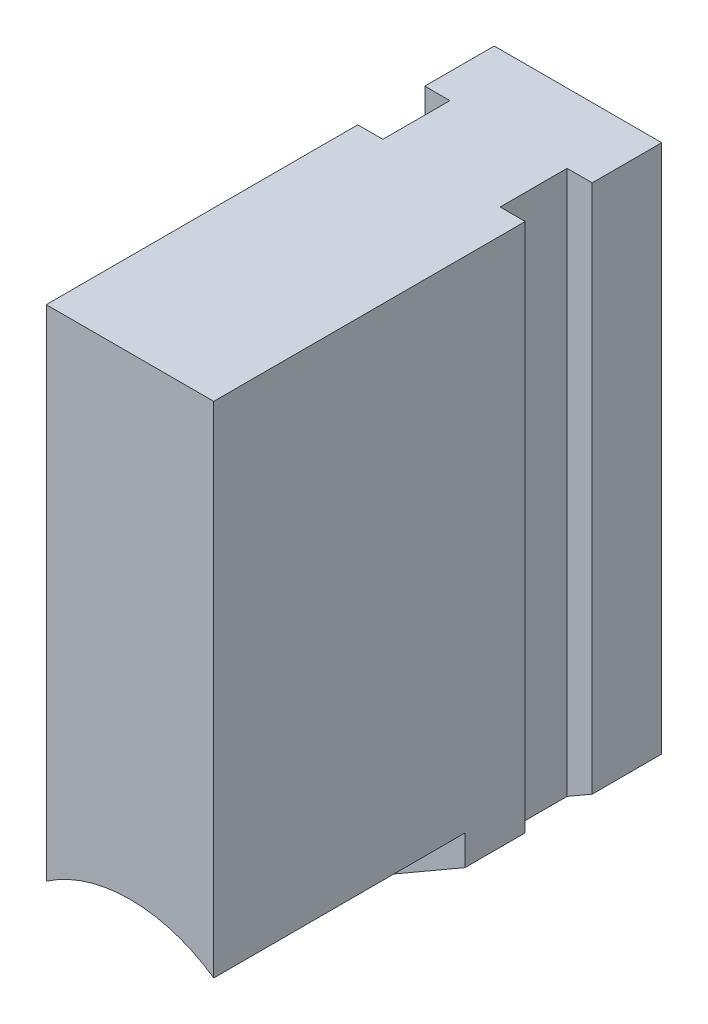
ISO-10303-21;
HEADER;
FILE_DESCRIPTION(('STEP AP214'),'2;1');
FILE_NAME('part.step','',(''),(''),'','','');
FILE_SCHEMA(('AUTOMOTIVE_DESIGN { 1 0 10303 214 1 1 1 1 }'));
ENDSEC;
DATA;
#1=APPLICATION_CONTEXT('core data for automotive mechanical design processes');
#2=APPLICATION_PROTOCOL_DEFINITION('international standard','automotive_design',2000,#1);
#3=PRODUCT_CONTEXT('',#1,'mechanical');
#4=PRODUCT('Part','Part','',(#3));
#5=PRODUCT_RELATED_PRODUCT_CATEGORY('part','',(#4));
#6=PRODUCT_DEFINITION_FORMATION('','',#4);
#7=PRODUCT_DEFINITION_CONTEXT('part definition',#1,'design');
#8=PRODUCT_DEFINITION('design','',#6,#7);
#9=PRODUCT_DEFINITION_SHAPE('','',#8);
#10=(LENGTH_UNIT() NAMED_UNIT(*) SI_UNIT(.MILLI.,.METRE.));
#11=(NAMED_UNIT(*) PLANE_ANGLE_UNIT() SI_UNIT($,.RADIAN.));
#12=(NAMED_UNIT(*) SI_UNIT($,.STERADIAN.) SOLID_ANGLE_UNIT());
#13=UNCERTAINTY_MEASURE_WITH_UNIT(LENGTH_MEASURE(1.E-05),#10,'distance_accuracy_value','');
#14=(GEOMETRIC_REPRESENTATION_CONTEXT(3) GLOBAL_UNCERTAINTY_ASSIGNED_CONTEXT((#13)) GLOBAL_UNIT_ASSIGNED_CONTEXT((#10,
#11,#12)) REPRESENTATION_CONTEXT('',''));
#15=CARTESIAN_POINT('',(0.,0.,0.));
#16=DIRECTION('',(0.,0.,1.));
#17=DIRECTION('',(1.,0.,0.));
#18=AXIS2_PLACEMENT_3D('',#15,#16,#17);
#19=CARTESIAN_POINT('',(0.,0.,32.5));
#20=DIRECTION('',(0.499999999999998,0.86602540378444,0.));
#21=DIRECTION('',(-0.86602540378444,0.499999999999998,0.));
#22=AXIS2_PLACEMENT_3D('',#19,#20,#21);
#23=PLANE('',#22);
#24=DIRECTION('',(0.86602540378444,-0.499999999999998,0.));
#25=VECTOR('',#24,1.);
#26=CARTESIAN_POINT('',(0.,0.,2.5));
#27=LINE('',#26,#25);
#28=CARTESIAN_POINT('',(-10.,5.77350269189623,2.5));
#29=VERTEX_POINT('',#28);
#30=CARTESIAN_POINT('',(0.,0.,2.5));
#31=VERTEX_POINT('',#30);
#32=EDGE_CURVE('E145',#29,#31,#27,.T.);
#33=ORIENTED_EDGE('',*,*,#32,.F.);
#34=DIRECTION('',(0.,0.,-1.));
#35=VECTOR('',#34,1.);
#36=CARTESIAN_POINT('',(-10.,5.77350269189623,32.5));
#37=LINE('',#36,#35);
#38=CARTESIAN_POINT('',(-10.,5.77350269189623,-4.7));
#39=VERTEX_POINT('',#38);
#40=EDGE_CURVE('E222',#29,#39,#37,.T.);
#41=ORIENTED_EDGE('',*,*,#40,.T.);
#42=DIRECTION('',(-0.86602540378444,0.499999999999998,0.));
#43=VECTOR('',#42,1.);
#44=CARTESIAN_POINT('',(0.,0.,-4.7));
#45=LINE('',#44,#43);
#46=CARTESIAN_POINT('',(-7.,4.04145188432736,-4.7));
#47=VERTEX_POINT('',#46);
#48=EDGE_CURVE('E39',#47,#39,#45,.T.);
#49=ORIENTED_EDGE('',*,*,#48,.F.);
#50=DIRECTION('',(0.,0.,1.));
#51=VECTOR('',#50,1.);
#52=CARTESIAN_POINT('',(-7.,4.04145188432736,32.5));
#53=LINE('',#52,#51);
#54=CARTESIAN_POINT('',(-7.,4.04145188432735,-12.7));
#55=VERTEX_POINT('',#54);
#56=EDGE_CURVE('E240',#55,#47,#53,.T.);
#57=ORIENTED_EDGE('',*,*,#56,.F.);
#58=DIRECTION('',(0.86602540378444,-0.499999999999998,0.));
#59=VECTOR('',#58,1.);
#60=CARTESIAN_POINT('',(0.,0.,-12.7));
#61=LINE('',#60,#59);
#62=CARTESIAN_POINT('',(-10.,5.77350269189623,-12.7));
#63=VERTEX_POINT('',#62);
#64=EDGE_CURVE('E238',#63,#55,#61,.T.);
#65=ORIENTED_EDGE('',*,*,#64,.F.);
#66=CARTESIAN_POINT('',(-10.,5.77350269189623,-21.));
#67=VERTEX_POINT('',#66);
#68=EDGE_CURVE('E221',#63,#67,#37,.T.);
#69=ORIENTED_EDGE('',*,*,#68,.T.);
#70=DIRECTION('',(0.86602540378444,-0.499999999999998,0.));
#71=VECTOR('',#70,1.);
#72=CARTESIAN_POINT('',(0.,0.,-21.));
#73=LINE('',#72,#71);
#74=CARTESIAN_POINT('',(0.,0.,-21.));
#75=VERTEX_POINT('',#74);
#76=EDGE_CURVE('E204',#67,#75,#73,.T.);
#77=ORIENTED_EDGE('',*,*,#76,.T.);
#78=DIRECTION('',(0.,0.,-1.));
#79=VECTOR('',#78,1.);
#80=CARTESIAN_POINT('',(0.,0.,32.5));
#81=LINE('',#80,#79);
#82=EDGE_CURVE('E219',#31,#75,#81,.T.);
#83=ORIENTED_EDGE('',*,*,#82,.F.);
#84=EDGE_LOOP('',(#33,#41,#49,#57,#65,#69,#77,#83));
#85=FACE_BOUND('',#84,.T.);
#86=ADVANCED_FACE('F31',(#85),#23,.F.);
#87=CARTESIAN_POINT('',(0.,0.,32.5));
#88=DIRECTION('',(-0.499999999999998,0.86602540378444,0.));
#89=DIRECTION('',(-0.86602540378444,-0.499999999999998,0.));
#90=AXIS2_PLACEMENT_3D('',#87,#88,#89);
#91=PLANE('',#90);
#92=DIRECTION('',(0.86602540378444,0.499999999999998,0.));
#93=VECTOR('',#92,1.);
#94=CARTESIAN_POINT('',(0.,0.,2.5));
#95=LINE('',#94,#93);
#96=CARTESIAN_POINT('',(10.,5.77350269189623,2.5));
#97=VERTEX_POINT('',#96);
#98=EDGE_CURVE('E11',#31,#97,#95,.T.);
#99=ORIENTED_EDGE('',*,*,#98,.F.);
#100=ORIENTED_EDGE('',*,*,#82,.T.);
#101=DIRECTION('',(0.86602540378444,0.499999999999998,0.));
#102=VECTOR('',#101,1.);
#103=CARTESIAN_POINT('',(0.,0.,-21.));
#104=LINE('',#103,#102);
#105=CARTESIAN_POINT('',(10.,5.77350269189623,-21.));
#106=VERTEX_POINT('',#105);
#107=EDGE_CURVE('E207',#75,#106,#104,.T.);
#108=ORIENTED_EDGE('',*,*,#107,.T.);
#109=DIRECTION('',(0.,0.,-1.));
#110=VECTOR('',#109,1.);
#111=CARTESIAN_POINT('',(10.,5.77350269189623,32.5));
#112=LINE('',#111,#110);
#113=CARTESIAN_POINT('',(10.,5.77350269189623,-12.7));
#114=VERTEX_POINT('',#113);
#115=EDGE_CURVE('E216',#114,#106,#112,.T.);
#116=ORIENTED_EDGE('',*,*,#115,.F.);
#117=DIRECTION('',(0.86602540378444,0.499999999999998,0.));
#118=VECTOR('',#117,1.);
#119=CARTESIAN_POINT('',(0.,0.,-12.7));
#120=LINE('',#119,#118);
#121=CARTESIAN_POINT('',(7.,4.04145188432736,-12.7));
#122=VERTEX_POINT('',#121);
#123=EDGE_CURVE('E236',#122,#114,#120,.T.);
#124=ORIENTED_EDGE('',*,*,#123,.F.);
#125=DIRECTION('',(0.,0.,-1.));
#126=VECTOR('',#125,1.);
#127=CARTESIAN_POINT('',(7.,4.04145188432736,32.5));
#128=LINE('',#127,#126);
#129=CARTESIAN_POINT('',(7.,4.04145188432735,-4.7));
#130=VERTEX_POINT('',#129);
#131=EDGE_CURVE('E234',#130,#122,#128,.T.);
#132=ORIENTED_EDGE('',*,*,#131,.F.);
#133=DIRECTION('',(-0.86602540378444,-0.499999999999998,0.));
#134=VECTOR('',#133,1.);
#135=CARTESIAN_POINT('',(0.,0.,-4.7));
#136=LINE('',#135,#134);
#137=CARTESIAN_POINT('',(10.,5.77350269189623,-4.7));
#138=VERTEX_POINT('',#137);
#139=EDGE_CURVE('E232',#138,#130,#136,.T.);
#140=ORIENTED_EDGE('',*,*,#139,.F.);
#141=EDGE_CURVE('E217',#97,#138,#112,.T.);
#142=ORIENTED_EDGE('',*,*,#141,.F.);
#143=EDGE_LOOP('',(#99,#100,#108,#116,#124,#132,#140,#142));
#144=FACE_BOUND('',#143,.T.);
#145=ADVANCED_FACE('F282',(#144),#91,.F.);
#146=CARTESIAN_POINT('',(-10.,69.,32.5));
#147=DIRECTION('',(0.,-1.,0.));
#148=DIRECTION('',(0.,0.,-1.));
#149=AXIS2_PLACEMENT_3D('',#146,#147,#148);
#150=PLANE('',#149);
#151=DIRECTION('',(1.,0.,0.));
#152=VECTOR('',#151,1.);
#153=CARTESIAN_POINT('',(-17.,69.,-4.7));
#154=LINE('',#153,#152);
#155=CARTESIAN_POINT('',(-10.,69.,-4.7));
#156=VERTEX_POINT('',#155);
#157=CARTESIAN_POINT('',(-7.,69.,-4.7));
#158=VERTEX_POINT('',#157);
#159=EDGE_CURVE('E163',#156,#158,#154,.T.);
#160=ORIENTED_EDGE('',*,*,#159,.F.);
#161=DIRECTION('',(0.,0.,-1.));
#162=VECTOR('',#161,1.);
#163=CARTESIAN_POINT('',(-10.,69.,32.5));
#164=LINE('',#163,#162);
#165=CARTESIAN_POINT('',(-10.,69.,32.5));
#166=VERTEX_POINT('',#165);
#167=EDGE_CURVE('E225',#166,#156,#164,.T.);
#168=ORIENTED_EDGE('',*,*,#167,.F.);
#169=DIRECTION('',(-1.,0.,0.));
#170=VECTOR('',#169,1.);
#171=CARTESIAN_POINT('',(-10.,69.,32.5));
#172=LINE('',#171,#170);
#173=CARTESIAN_POINT('',(10.,69.,32.5));
#174=VERTEX_POINT('',#173);
#175=EDGE_CURVE('E211',#174,#166,#172,.T.);
#176=ORIENTED_EDGE('',*,*,#175,.F.);
#177=DIRECTION('',(0.,0.,-1.));
#178=VECTOR('',#177,1.);
#179=CARTESIAN_POINT('',(10.,69.,32.5));
#180=LINE('',#179,#178);
#181=CARTESIAN_POINT('',(10.,69.,-4.7));
#182=VERTEX_POINT('',#181);
#183=EDGE_CURVE('E229',#174,#182,#180,.T.);
#184=ORIENTED_EDGE('',*,*,#183,.T.);
#185=DIRECTION('',(1.,0.,0.));
#186=VECTOR('',#185,1.);
#187=CARTESIAN_POINT('',(17.,69.,-4.7));
#188=LINE('',#187,#186);
#189=CARTESIAN_POINT('',(7.,69.,-4.7));
#190=VERTEX_POINT('',#189);
#191=EDGE_CURVE('E182',#190,#182,#188,.T.);
#192=ORIENTED_EDGE('',*,*,#191,.F.);
#193=DIRECTION('',(0.,0.,1.));
#194=VECTOR('',#193,1.);
#195=CARTESIAN_POINT('',(7.,69.,-12.7));
#196=LINE('',#195,#194);
#197=CARTESIAN_POINT('',(7.,69.,-12.7));
#198=VERTEX_POINT('',#197);
#199=EDGE_CURVE('E180',#198,#190,#196,.T.);
#200=ORIENTED_EDGE('',*,*,#199,.F.);
#201=DIRECTION('',(-1.,0.,0.));
#202=VECTOR('',#201,1.);
#203=CARTESIAN_POINT('',(17.,69.,-12.7));
#204=LINE('',#203,#202);
#205=CARTESIAN_POINT('',(10.,69.,-12.7));
#206=VERTEX_POINT('',#205);
#207=EDGE_CURVE('E178',#206,#198,#204,.T.);
#208=ORIENTED_EDGE('',*,*,#207,.F.);
#209=CARTESIAN_POINT('',(10.,69.,-21.));
#210=VERTEX_POINT('',#209);
#211=EDGE_CURVE('E228',#206,#210,#180,.T.);
#212=ORIENTED_EDGE('',*,*,#211,.T.);
#213=DIRECTION('',(-1.,0.,0.));
#214=VECTOR('',#213,1.);
#215=CARTESIAN_POINT('',(-10.,69.,-21.));
#216=LINE('',#215,#214);
#217=CARTESIAN_POINT('',(-10.,69.,-21.));
#218=VERTEX_POINT('',#217);
#219=EDGE_CURVE('E198',#210,#218,#216,.T.);
#220=ORIENTED_EDGE('',*,*,#219,.T.);
#221=CARTESIAN_POINT('',(-10.,69.,-12.7));
#222=VERTEX_POINT('',#221);
#223=EDGE_CURVE('E224',#222,#218,#164,.T.);
#224=ORIENTED_EDGE('',*,*,#223,.F.);
#225=DIRECTION('',(-1.,0.,0.));
#226=VECTOR('',#225,1.);
#227=CARTESIAN_POINT('',(-17.,69.,-12.7));
#228=LINE('',#227,#226);
#229=CARTESIAN_POINT('',(-7.,69.,-12.7));
#230=VERTEX_POINT('',#229);
#231=EDGE_CURVE('E167',#230,#222,#228,.T.);
#232=ORIENTED_EDGE('',*,*,#231,.F.);
#233=DIRECTION('',(0.,0.,-1.));
#234=VECTOR('',#233,1.);
#235=CARTESIAN_POINT('',(-7.,69.,-12.7));
#236=LINE('',#235,#234);
#237=EDGE_CURVE('E165',#158,#230,#236,.T.);
#238=ORIENTED_EDGE('',*,*,#237,.F.);
#239=EDGE_LOOP('',(#160,#168,#176,#184,#192,#200,#208,#212,#220,#224,#232,#238));
#240=FACE_BOUND('',#239,.T.);
#241=ADVANCED_FACE('F257',(#240),#150,.F.);
#242=CARTESIAN_POINT('',(-10.,5.77350269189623,32.5));
#243=DIRECTION('',(1.,0.,0.));
#244=DIRECTION('',(0.,0.,-1.));
#245=AXIS2_PLACEMENT_3D('',#242,#243,#244);
#246=PLANE('',#245);
#247=DIRECTION('',(0.,-1.,0.));
#248=VECTOR('',#247,1.);
#249=CARTESIAN_POINT('',(-10.,5.77350269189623,2.5));
#250=LINE('',#249,#248);
#251=CARTESIAN_POINT('',(-10.,9.3614066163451,2.5));
#252=VERTEX_POINT('',#251);
#253=EDGE_CURVE('E161',#252,#29,#250,.T.);
#254=ORIENTED_EDGE('',*,*,#253,.F.);
#255=DIRECTION('',(0.,0.,1.));
#256=VECTOR('',#255,1.);
#257=CARTESIAN_POINT('',(-10.,9.3614066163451,2.5));
#258=LINE('',#257,#256);
#259=CARTESIAN_POINT('',(-10.,9.3614066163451,32.5));
#260=VERTEX_POINT('',#259);
#261=EDGE_CURVE('E146',#252,#260,#258,.T.);
#262=ORIENTED_EDGE('',*,*,#261,.T.);
#263=DIRECTION('',(0.,-1.,0.));
#264=VECTOR('',#263,1.);
#265=CARTESIAN_POINT('',(-10.,5.77350269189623,32.5));
#266=LINE('',#265,#264);
#267=EDGE_CURVE('E213',#166,#260,#266,.T.);
#268=ORIENTED_EDGE('',*,*,#267,.F.);
#269=ORIENTED_EDGE('',*,*,#167,.T.);
#270=DIRECTION('',(0.,1.,0.));
#271=VECTOR('',#270,1.);
#272=CARTESIAN_POINT('',(-10.,5.77350269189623,-4.7));
#273=LINE('',#272,#271);
#274=EDGE_CURVE('E176',#39,#156,#273,.T.);
#275=ORIENTED_EDGE('',*,*,#274,.F.);
#276=ORIENTED_EDGE('',*,*,#40,.F.);
#277=EDGE_LOOP('',(#254,#262,#268,#269,#275,#276));
#278=FACE_BOUND('',#277,.T.);
#279=ADVANCED_FACE('F252',(#278),#246,.F.);
#280=DIRECTION('',(0.,-1.,0.));
#281=VECTOR('',#280,1.);
#282=CARTESIAN_POINT('',(-10.,5.77350269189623,-12.7));
#283=LINE('',#282,#281);
#284=EDGE_CURVE('E54',#222,#63,#283,.T.);
#285=ORIENTED_EDGE('',*,*,#284,.F.);
#286=ORIENTED_EDGE('',*,*,#223,.T.);
#287=DIRECTION('',(0.,-1.,0.));
#288=VECTOR('',#287,1.);
#289=CARTESIAN_POINT('',(-10.,5.77350269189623,-21.));
#290=LINE('',#289,#288);
#291=EDGE_CURVE('E201',#218,#67,#290,.T.);
#292=ORIENTED_EDGE('',*,*,#291,.T.);
#293=ORIENTED_EDGE('',*,*,#68,.F.);
#294=EDGE_LOOP('',(#285,#286,#292,#293));
#295=FACE_BOUND('',#294,.T.);
#296=ADVANCED_FACE('F267',(#295),#246,.F.);
#297=CARTESIAN_POINT('',(10.,5.77350269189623,32.5));
#298=DIRECTION('',(-1.,0.,0.));
#299=DIRECTION('',(0.,0.,1.));
#300=AXIS2_PLACEMENT_3D('',#297,#298,#299);
#301=PLANE('',#300);
#302=DIRECTION('',(0.,1.,0.));
#303=VECTOR('',#302,1.);
#304=CARTESIAN_POINT('',(10.,5.77350269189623,-12.7));
#305=LINE('',#304,#303);
#306=EDGE_CURVE('E193',#114,#206,#305,.T.);
#307=ORIENTED_EDGE('',*,*,#306,.F.);
#308=ORIENTED_EDGE('',*,*,#115,.T.);
#309=DIRECTION('',(0.,1.,0.));
#310=VECTOR('',#309,1.);
#311=CARTESIAN_POINT('',(10.,5.77350269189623,-21.));
#312=LINE('',#311,#310);
#313=EDGE_CURVE('E195',#106,#210,#312,.T.);
#314=ORIENTED_EDGE('',*,*,#313,.T.);
#315=ORIENTED_EDGE('',*,*,#211,.F.);
#316=EDGE_LOOP('',(#307,#308,#314,#315));
#317=FACE_BOUND('',#316,.T.);
#318=ADVANCED_FACE('F33',(#317),#301,.F.);
#319=DIRECTION('',(0.,1.,0.));
#320=VECTOR('',#319,1.);
#321=CARTESIAN_POINT('',(10.,5.77350269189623,32.5));
#322=LINE('',#321,#320);
#323=CARTESIAN_POINT('',(10.,9.36140661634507,32.5));
#324=VERTEX_POINT('',#323);
#325=EDGE_CURVE('E155',#324,#174,#322,.T.);
#326=ORIENTED_EDGE('',*,*,#325,.F.);
#327=DIRECTION('',(0.,0.,1.));
#328=VECTOR('',#327,1.);
#329=CARTESIAN_POINT('',(10.,9.36140661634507,2.5));
#330=LINE('',#329,#328);
#331=CARTESIAN_POINT('',(10.,9.36140661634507,2.5));
#332=VERTEX_POINT('',#331);
#333=EDGE_CURVE('E46',#324,#332,#330,.F.);
#334=ORIENTED_EDGE('',*,*,#333,.T.);
#335=DIRECTION('',(0.,1.,0.));
#336=VECTOR('',#335,1.);
#337=CARTESIAN_POINT('',(10.,5.77350269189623,2.5));
#338=LINE('',#337,#336);
#339=EDGE_CURVE('E138',#97,#332,#338,.T.);
#340=ORIENTED_EDGE('',*,*,#339,.F.);
#341=ORIENTED_EDGE('',*,*,#141,.T.);
#342=DIRECTION('',(0.,-1.,0.));
#343=VECTOR('',#342,1.);
#344=CARTESIAN_POINT('',(10.,5.77350269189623,-4.7));
#345=LINE('',#344,#343);
#346=EDGE_CURVE('E190',#182,#138,#345,.T.);
#347=ORIENTED_EDGE('',*,*,#346,.F.);
#348=ORIENTED_EDGE('',*,*,#183,.F.);
#349=EDGE_LOOP('',(#326,#334,#340,#341,#347,#348));
#350=FACE_BOUND('',#349,.T.);
#351=ADVANCED_FACE('F153',(#350),#301,.F.);
#352=CARTESIAN_POINT('',(10.,69.,32.5));
#353=DIRECTION('',(0.,0.,-1.));
#354=DIRECTION('',(-1.,0.,0.));
#355=AXIS2_PLACEMENT_3D('',#352,#353,#354);
#356=PLANE('',#355);
#357=ORIENTED_EDGE('',*,*,#267,.T.);
#358=CARTESIAN_POINT('',(0.,-4.99999999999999,32.5));
#359=DIRECTION('',(0.,0.,1.));
#360=DIRECTION('',(1.,0.,0.));
#361=AXIS2_PLACEMENT_3D('',#358,#359,#360);
#362=CIRCLE('',#361,17.5);
#363=EDGE_CURVE('E150',#324,#260,#362,.T.);
#364=ORIENTED_EDGE('',*,*,#363,.F.);
#365=ORIENTED_EDGE('',*,*,#325,.T.);
#366=ORIENTED_EDGE('',*,*,#175,.T.);
#367=EDGE_LOOP('',(#357,#364,#365,#366));
#368=FACE_BOUND('',#367,.T.);
#369=ADVANCED_FACE('F286',(#368),#356,.F.);
#370=CARTESIAN_POINT('',(10.,69.,-21.));
#371=DIRECTION('',(0.,0.,-1.));
#372=DIRECTION('',(-1.,0.,0.));
#373=AXIS2_PLACEMENT_3D('',#370,#371,#372);
#374=PLANE('',#373);
#375=ORIENTED_EDGE('',*,*,#313,.F.);
#376=ORIENTED_EDGE('',*,*,#107,.F.);
#377=ORIENTED_EDGE('',*,*,#76,.F.);
#378=ORIENTED_EDGE('',*,*,#291,.F.);
#379=ORIENTED_EDGE('',*,*,#219,.F.);
#380=EDGE_LOOP('',(#375,#376,#377,#378,#379));
#381=FACE_BOUND('',#380,.T.);
#382=ADVANCED_FACE('F273',(#381),#374,.T.);
#383=CARTESIAN_POINT('',(17.,69.,-12.7));
#384=DIRECTION('',(0.,0.,1.));
#385=DIRECTION('',(1.,0.,0.));
#386=AXIS2_PLACEMENT_3D('',#383,#384,#385);
#387=PLANE('',#386);
#388=ORIENTED_EDGE('',*,*,#306,.T.);
#389=ORIENTED_EDGE('',*,*,#207,.T.);
#390=DIRECTION('',(0.,-1.,0.));
#391=VECTOR('',#390,1.);
#392=CARTESIAN_POINT('',(7.,69.,-12.7));
#393=LINE('',#392,#391);
#394=EDGE_CURVE('E187',#198,#122,#393,.T.);
#395=ORIENTED_EDGE('',*,*,#394,.T.);
#396=ORIENTED_EDGE('',*,*,#123,.T.);
#397=EDGE_LOOP('',(#388,#389,#395,#396));
#398=FACE_BOUND('',#397,.T.);
#399=ADVANCED_FACE('F293',(#398),#387,.T.);
#400=CARTESIAN_POINT('',(7.,69.,-12.7));
#401=DIRECTION('',(1.,0.,0.));
#402=DIRECTION('',(0.,0.,-1.));
#403=AXIS2_PLACEMENT_3D('',#400,#401,#402);
#404=PLANE('',#403);
#405=ORIENTED_EDGE('',*,*,#131,.T.);
#406=ORIENTED_EDGE('',*,*,#394,.F.);
#407=ORIENTED_EDGE('',*,*,#199,.T.);
#408=DIRECTION('',(0.,-1.,0.));
#409=VECTOR('',#408,1.);
#410=CARTESIAN_POINT('',(7.,69.,-4.7));
#411=LINE('',#410,#409);
#412=EDGE_CURVE('E184',#190,#130,#411,.T.);
#413=ORIENTED_EDGE('',*,*,#412,.T.);
#414=EDGE_LOOP('',(#405,#406,#407,#413));
#415=FACE_BOUND('',#414,.T.);
#416=ADVANCED_FACE('F365',(#415),#404,.T.);
#417=CARTESIAN_POINT('',(17.,69.,-4.7));
#418=DIRECTION('',(0.,0.,-1.));
#419=DIRECTION('',(-1.,0.,0.));
#420=AXIS2_PLACEMENT_3D('',#417,#418,#419);
#421=PLANE('',#420);
#422=ORIENTED_EDGE('',*,*,#346,.T.);
#423=ORIENTED_EDGE('',*,*,#139,.T.);
#424=ORIENTED_EDGE('',*,*,#412,.F.);
#425=ORIENTED_EDGE('',*,*,#191,.T.);
#426=EDGE_LOOP('',(#422,#423,#424,#425));
#427=FACE_BOUND('',#426,.T.);
#428=ADVANCED_FACE('F362',(#427),#421,.T.);
#429=CARTESIAN_POINT('',(-17.,69.,-4.7));
#430=DIRECTION('',(0.,0.,-1.));
#431=DIRECTION('',(-1.,0.,0.));
#432=AXIS2_PLACEMENT_3D('',#429,#430,#431);
#433=PLANE('',#432);
#434=ORIENTED_EDGE('',*,*,#274,.T.);
#435=ORIENTED_EDGE('',*,*,#159,.T.);
#436=DIRECTION('',(0.,-1.,0.));
#437=VECTOR('',#436,1.);
#438=CARTESIAN_POINT('',(-7.,69.,-4.7));
#439=LINE('',#438,#437);
#440=EDGE_CURVE('E172',#158,#47,#439,.T.);
#441=ORIENTED_EDGE('',*,*,#440,.T.);
#442=ORIENTED_EDGE('',*,*,#48,.T.);
#443=EDGE_LOOP('',(#434,#435,#441,#442));
#444=FACE_BOUND('',#443,.T.);
#445=ADVANCED_FACE('F245',(#444),#433,.T.);
#446=CARTESIAN_POINT('',(-7.,69.,-12.7));
#447=DIRECTION('',(-1.,0.,0.));
#448=DIRECTION('',(0.,0.,1.));
#449=AXIS2_PLACEMENT_3D('',#446,#447,#448);
#450=PLANE('',#449);
#451=ORIENTED_EDGE('',*,*,#56,.T.);
#452=ORIENTED_EDGE('',*,*,#440,.F.);
#453=ORIENTED_EDGE('',*,*,#237,.T.);
#454=DIRECTION('',(0.,-1.,0.));
#455=VECTOR('',#454,1.);
#456=CARTESIAN_POINT('',(-7.,69.,-12.7));
#457=LINE('',#456,#455);
#458=EDGE_CURVE('E169',#230,#55,#457,.T.);
#459=ORIENTED_EDGE('',*,*,#458,.T.);
#460=EDGE_LOOP('',(#451,#452,#453,#459));
#461=FACE_BOUND('',#460,.T.);
#462=ADVANCED_FACE('F261',(#461),#450,.T.);
#463=CARTESIAN_POINT('',(-17.,69.,-12.7));
#464=DIRECTION('',(0.,0.,1.));
#465=DIRECTION('',(1.,0.,0.));
#466=AXIS2_PLACEMENT_3D('',#463,#464,#465);
#467=PLANE('',#466);
#468=ORIENTED_EDGE('',*,*,#284,.T.);
#469=ORIENTED_EDGE('',*,*,#64,.T.);
#470=ORIENTED_EDGE('',*,*,#458,.F.);
#471=ORIENTED_EDGE('',*,*,#231,.T.);
#472=EDGE_LOOP('',(#468,#469,#470,#471));
#473=FACE_BOUND('',#472,.T.);
#474=ADVANCED_FACE('F342',(#473),#467,.T.);
#475=CARTESIAN_POINT('',(0.,-4.99999999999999,2.5));
#476=DIRECTION('',(0.,0.,1.));
#477=DIRECTION('',(1.,0.,0.));
#478=AXIS2_PLACEMENT_3D('',#475,#476,#477);
#479=PLANE('',#478);
#480=ORIENTED_EDGE('',*,*,#253,.T.);
#481=ORIENTED_EDGE('',*,*,#32,.T.);
#482=ORIENTED_EDGE('',*,*,#98,.T.);
#483=ORIENTED_EDGE('',*,*,#339,.T.);
#484=CARTESIAN_POINT('',(0.,-4.99999999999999,2.5));
#485=DIRECTION('',(0.,0.,1.));
#486=DIRECTION('',(1.,0.,0.));
#487=AXIS2_PLACEMENT_3D('',#484,#485,#486);
#488=CIRCLE('',#487,17.5);
#489=EDGE_CURVE('E140',#332,#252,#488,.T.);
#490=ORIENTED_EDGE('',*,*,#489,.T.);
#491=EDGE_LOOP('',(#480,#481,#482,#483,#490));
#492=FACE_BOUND('',#491,.T.);
#493=ADVANCED_FACE('F139',(#492),#479,.T.);
#494=CARTESIAN_POINT('',(0.,-4.99999999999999,2.5));
#495=DIRECTION('',(0.,0.,1.));
#496=DIRECTION('',(1.,0.,0.));
#497=AXIS2_PLACEMENT_3D('',#494,#495,#496);
#498=CYLINDRICAL_SURFACE('',#497,17.5);
#499=ORIENTED_EDGE('',*,*,#489,.F.);
#500=ORIENTED_EDGE('',*,*,#333,.F.);
#501=ORIENTED_EDGE('',*,*,#363,.T.);
#502=ORIENTED_EDGE('',*,*,#261,.F.);
#503=EDGE_LOOP('',(#499,#500,#501,#502));
#504=FACE_BOUND('',#503,.T.);
#505=ADVANCED_FACE('F148',(#504),#498,.F.);
#506=CLOSED_SHELL('',(#86,#145,#241,#279,#296,#318,#351,#369,#382,#399,#416,#428,#445,#462,#474,
#493,#505));
#507=MANIFOLD_SOLID_BREP('B2',#506);
#508=ADVANCED_BREP_SHAPE_REPRESENTATION('',(#18,#507),#14);
#509=SHAPE_DEFINITION_REPRESENTATION(#9,#508);
ENDSEC;
END-ISO-10303-21;
